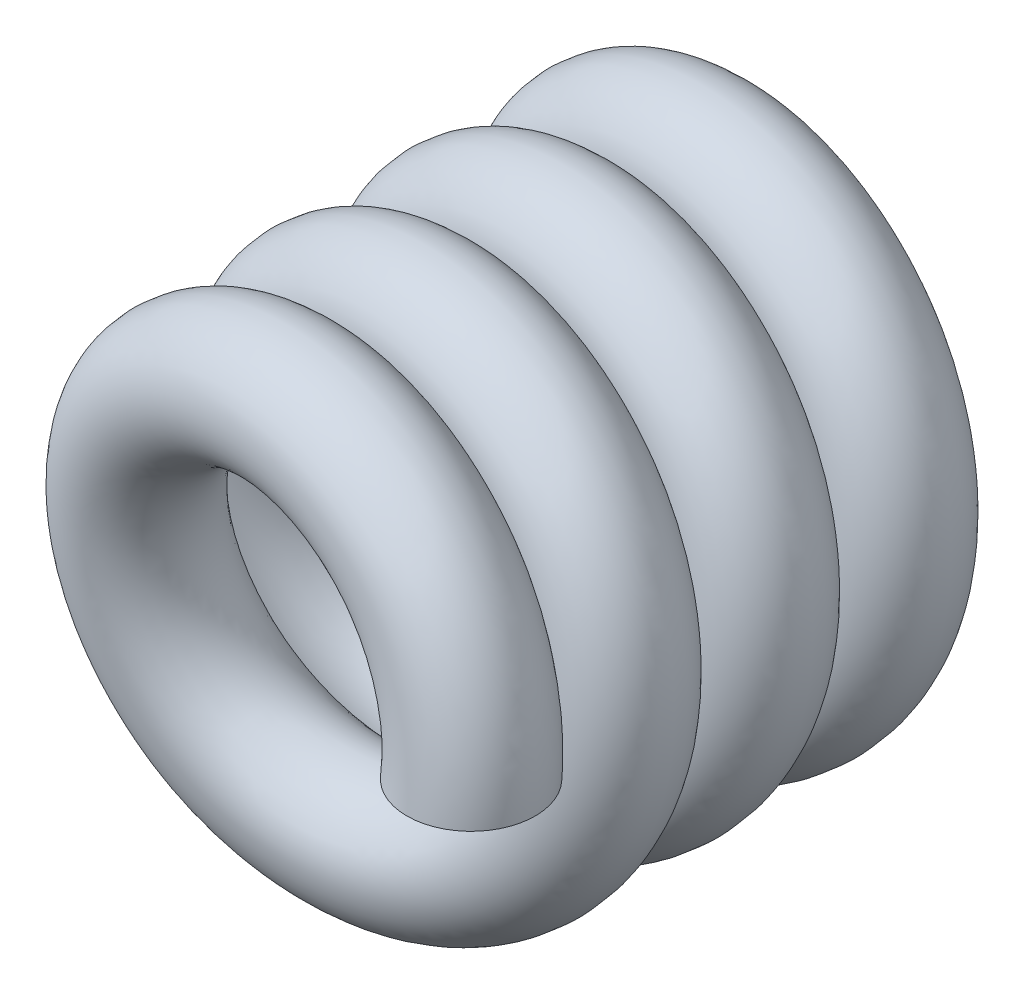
from build123d import *

# Parameters (mm, degrees)
SWEEP1_PITCH       = 1.397
SWEEP1_HEIGHT      = 5.23875
SWEEP1_RADIUS      = 3.175
SWEEP1_START_ANGLE = -90
SKETCH4_R          = 0.6477


with BuildPart() as part:
    # Sweep1: sweep along a helix
    with BuildLine() as sweep1_path:
        add(Helix(SWEEP1_PITCH, SWEEP1_HEIGHT, SWEEP1_RADIUS, center=(0, 0, 0), direction=(0, 0, 1), lefthand=True, mode=Mode.PRIVATE).rotate(Axis((0, 0, 0), (0, 0, 1)), SWEEP1_START_ANGLE))
    # Sketch4 → Sweep1 (sweep)
    with BuildSketch(Plane(origin=(0, 0, 0), x_dir=(1, 0, 0), z_dir=(0, 1, 0))):
        with Locations((-2.032, 0)):
            Circle(SKETCH4_R)
    sweep(path=sweep1_path.line, is_frenet=True)


solid = part.part
